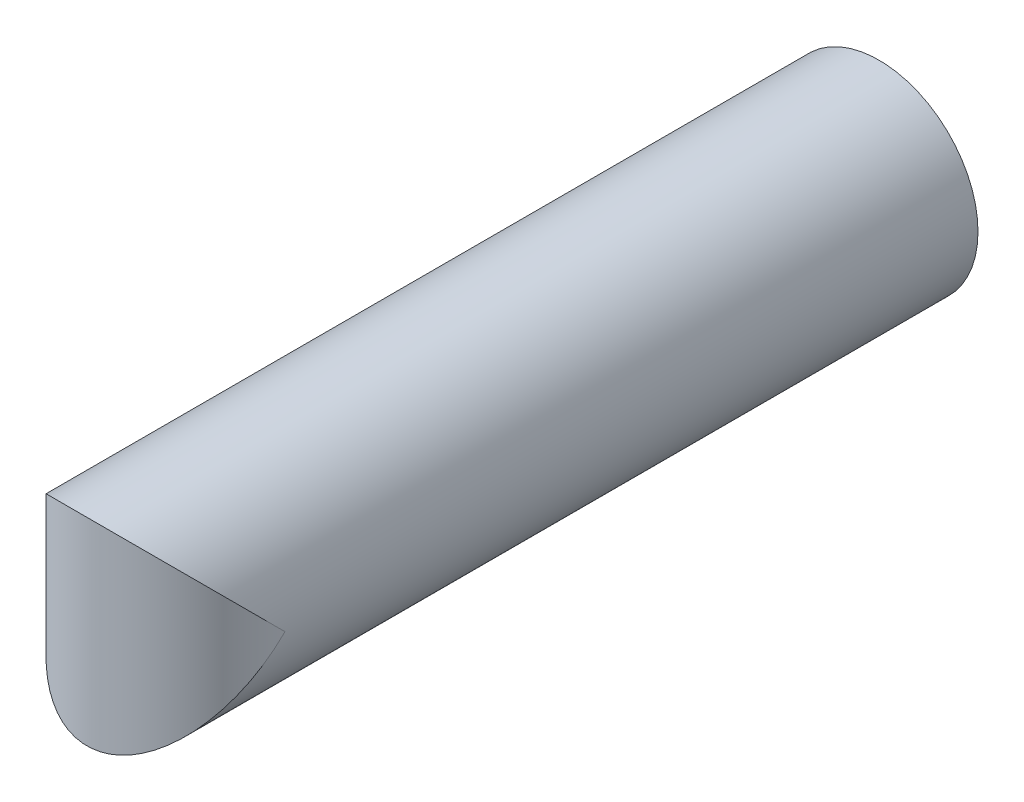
ISO-10303-21;
HEADER;
FILE_DESCRIPTION(('STEP AP214'),'2;1');
FILE_NAME('part.step','',(''),(''),'','','');
FILE_SCHEMA(('AUTOMOTIVE_DESIGN { 1 0 10303 214 1 1 1 1 }'));
ENDSEC;
DATA;
#1=APPLICATION_CONTEXT('core data for automotive mechanical design processes');
#2=APPLICATION_PROTOCOL_DEFINITION('international standard','automotive_design',2000,#1);
#3=PRODUCT_CONTEXT('',#1,'mechanical');
#4=PRODUCT('Part','Part','',(#3));
#5=PRODUCT_RELATED_PRODUCT_CATEGORY('part','',(#4));
#6=PRODUCT_DEFINITION_FORMATION('','',#4);
#7=PRODUCT_DEFINITION_CONTEXT('part definition',#1,'design');
#8=PRODUCT_DEFINITION('design','',#6,#7);
#9=PRODUCT_DEFINITION_SHAPE('','',#8);
#10=(LENGTH_UNIT() NAMED_UNIT(*) SI_UNIT(.MILLI.,.METRE.));
#11=(NAMED_UNIT(*) PLANE_ANGLE_UNIT() SI_UNIT($,.RADIAN.));
#12=(NAMED_UNIT(*) SI_UNIT($,.STERADIAN.) SOLID_ANGLE_UNIT());
#13=UNCERTAINTY_MEASURE_WITH_UNIT(LENGTH_MEASURE(1.E-05),#10,'distance_accuracy_value','');
#14=(GEOMETRIC_REPRESENTATION_CONTEXT(3) GLOBAL_UNCERTAINTY_ASSIGNED_CONTEXT((#13)) GLOBAL_UNIT_ASSIGNED_CONTEXT((#10,
#11,#12)) REPRESENTATION_CONTEXT('',''));
#15=CARTESIAN_POINT('',(0.,0.,0.));
#16=DIRECTION('',(0.,0.,1.));
#17=DIRECTION('',(1.,0.,0.));
#18=AXIS2_PLACEMENT_3D('',#15,#16,#17);
#19=CARTESIAN_POINT('',(0.,0.,20.));
#20=DIRECTION('',(0.,0.,-1.));
#21=DIRECTION('',(-1.,0.,0.));
#22=AXIS2_PLACEMENT_3D('',#19,#20,#21);
#23=CYLINDRICAL_SURFACE('',#22,2.5);
#24=CARTESIAN_POINT('',(0.,0.,17.5));
#25=DIRECTION('',(0.,-0.707106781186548,-0.707106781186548));
#26=DIRECTION('',(0.,0.707106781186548,-0.707106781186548));
#27=AXIS2_PLACEMENT_3D('',#24,#25,#26);
#28=ELLIPSE('',#27,3.53553390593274,2.5);
#29=CARTESIAN_POINT('',(2.5,0.,17.5));
#30=VERTEX_POINT('',#29);
#31=CARTESIAN_POINT('',(-2.5,0.,17.5));
#32=VERTEX_POINT('',#31);
#33=EDGE_CURVE('E38',#30,#32,#28,.T.);
#34=ORIENTED_EDGE('',*,*,#33,.T.);
#35=CARTESIAN_POINT('',(0.,0.,17.5));
#36=DIRECTION('',(0.,0.707106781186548,-0.707106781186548));
#37=DIRECTION('',(0.,-0.707106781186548,-0.707106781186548));
#38=AXIS2_PLACEMENT_3D('',#35,#36,#37);
#39=ELLIPSE('',#38,3.53553390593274,2.5);
#40=EDGE_CURVE('E44',#32,#30,#39,.T.);
#41=ORIENTED_EDGE('',*,*,#40,.T.);
#42=EDGE_LOOP('',(#34,#41));
#43=FACE_BOUND('',#42,.T.);
#44=CARTESIAN_POINT('',(0.,0.,0.));
#45=DIRECTION('',(0.,0.,1.));
#46=DIRECTION('',(1.,0.,0.));
#47=AXIS2_PLACEMENT_3D('',#44,#45,#46);
#48=CIRCLE('',#47,2.5);
#49=CARTESIAN_POINT('',(2.5,0.,0.));
#50=VERTEX_POINT('',#49);
#51=EDGE_CURVE('E11',#50,#50,#48,.T.);
#52=ORIENTED_EDGE('',*,*,#51,.T.);
#53=EDGE_LOOP('',(#52));
#54=FACE_BOUND('',#53,.T.);
#55=ADVANCED_FACE('F31',(#43,#54),#23,.T.);
#56=CARTESIAN_POINT('',(0.,0.,0.));
#57=DIRECTION('',(0.,0.,1.));
#58=DIRECTION('',(1.,0.,0.));
#59=AXIS2_PLACEMENT_3D('',#56,#57,#58);
#60=PLANE('',#59);
#61=ORIENTED_EDGE('',*,*,#51,.F.);
#62=EDGE_LOOP('',(#61));
#63=FACE_BOUND('',#62,.T.);
#64=ADVANCED_FACE('F51',(#63),#60,.F.);
#65=CARTESIAN_POINT('',(0.,-2.5,17.5));
#66=DIRECTION('',(0.,1.,0.));
#67=DIRECTION('',(0.,0.,1.));
#68=AXIS2_PLACEMENT_3D('',#65,#66,#67);
#69=CYLINDRICAL_SURFACE('',#68,2.5);
#70=ORIENTED_EDGE('',*,*,#40,.F.);
#71=ORIENTED_EDGE('',*,*,#33,.F.);
#72=EDGE_LOOP('',(#70,#71));
#73=FACE_BOUND('',#72,.T.);
#74=ADVANCED_FACE('F46',(#73),#69,.T.);
#75=CLOSED_SHELL('',(#55,#64,#74));
#76=MANIFOLD_SOLID_BREP('B2',#75);
#77=ADVANCED_BREP_SHAPE_REPRESENTATION('',(#18,#76),#14);
#78=SHAPE_DEFINITION_REPRESENTATION(#9,#77);
ENDSEC;
END-ISO-10303-21;
